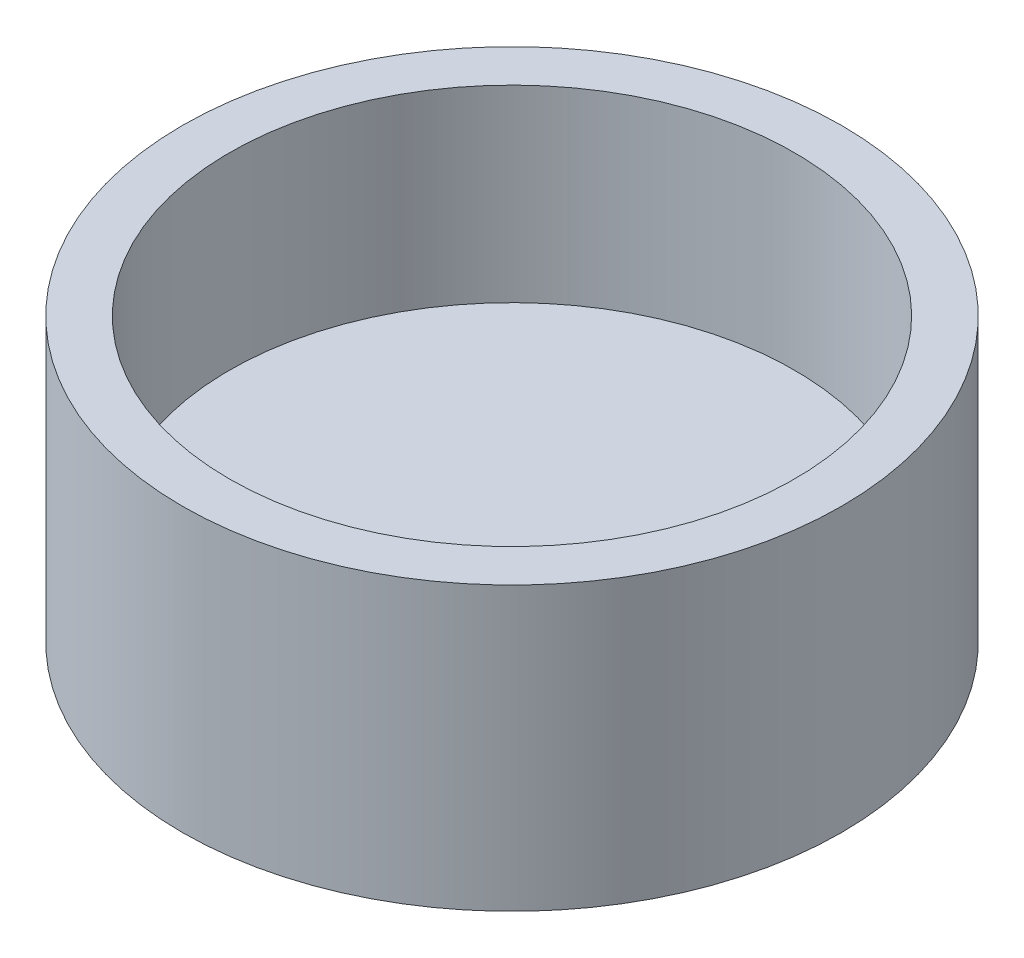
from build123d import *

# Parameters (mm, degrees)
SKETCH1_R           = 44.45
BOSS_EXTRUDE1_DEPTH = 38.1
SKETCH2_R           = 38.1
CUT_EXTRUDE1_DEPTH  = 25.4


with BuildPart() as part:
    # Sketch1 → Boss-Extrude1 (new body)
    with BuildSketch(Plane(origin=(0, 0, 0), x_dir=(1, 0, 0), z_dir=(0, 1, 0))):
        with Locations(Location((0, 0, 0), (0, 0, 90))):
            Circle(SKETCH1_R)
    extrude(amount=BOSS_EXTRUDE1_DEPTH)

    # Sketch2 → Cut-Extrude1 (cut)
    with BuildSketch(Plane(origin=(0, 38.1, 0), x_dir=(1, 0, 0), z_dir=(0, 1, 0))):
        with Locations(Location((0, 0, 0), (0, 0, 270))):
            Circle(SKETCH2_R)
    extrude(amount=-CUT_EXTRUDE1_DEPTH, mode=Mode.SUBTRACT)


solid = part.part
